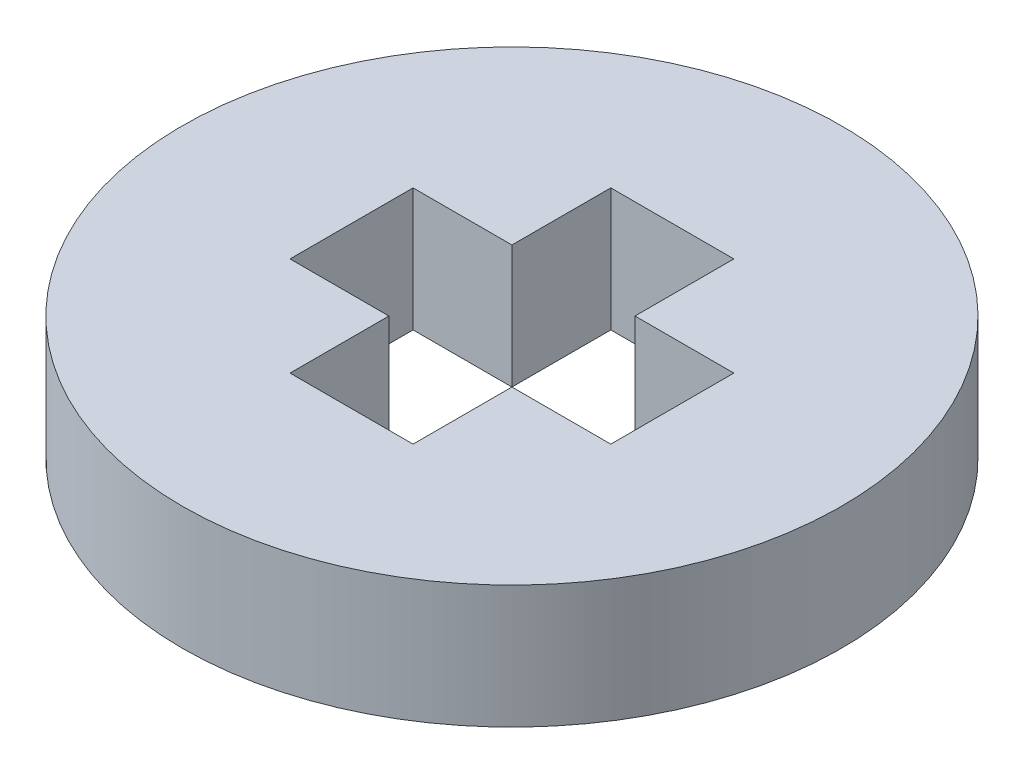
from build123d import *

# Parameters (mm, degrees)
SKETCH1_R           = 7.5
BOSS_EXTRUDE1_DEPTH = 2.8


with BuildPart() as part:
    # Sketch1 → Boss-Extrude1 (new body)
    with BuildSketch(Plane(origin=(0, 0, 0), x_dir=(1, 0, 0), z_dir=(0, 1, 0))):
        with Locations(Location((0, 0, 0), (0, 0, 270))):
            Circle(SKETCH1_R)
        Polygon((1.4, 3.65), (-1.4, 3.65), (-1.4, 1.4), (-3.65, 1.4), (-3.65, -1.4), (-1.4, -1.4), (-1.4, -3.65), (1.4, -3.65), (1.4, -1.4), (3.65, -1.4), (3.65, 1.4), (1.4, 1.4), align=None, mode=Mode.SUBTRACT)
    extrude(amount=BOSS_EXTRUDE1_DEPTH)


solid = part.part
